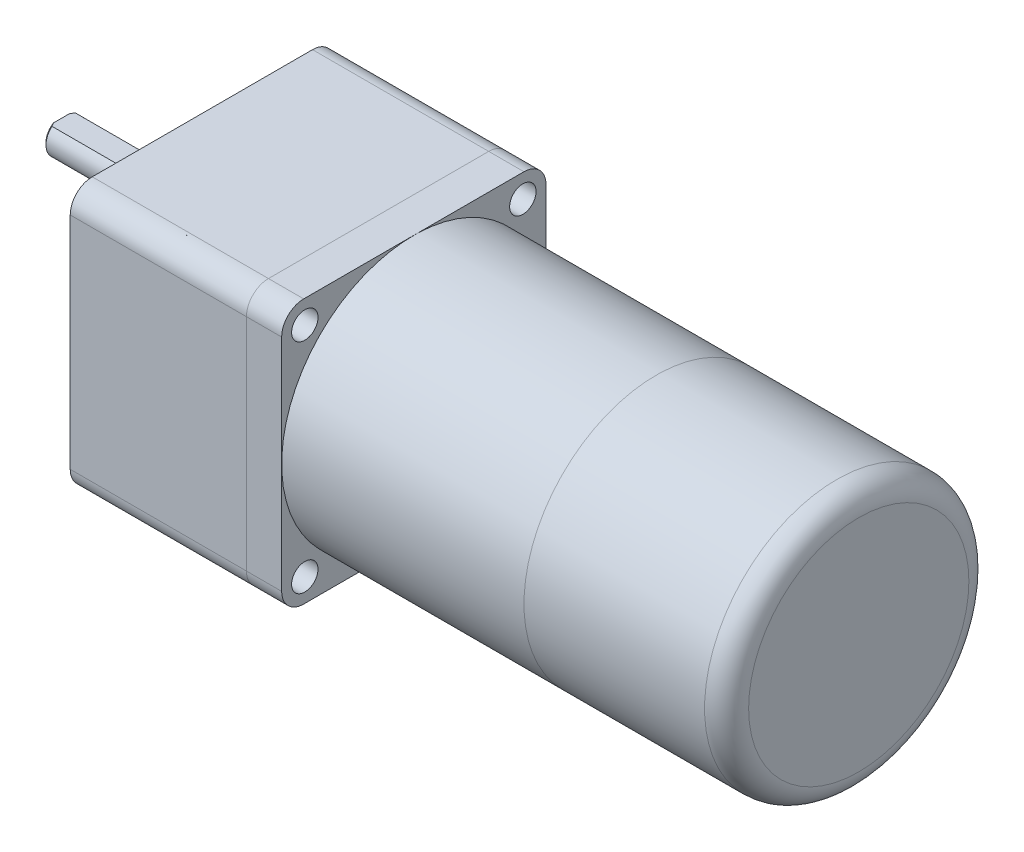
ISO-10303-21;
HEADER;
FILE_DESCRIPTION(('STEP AP214'),'2;1');
FILE_NAME('part.step','',(''),(''),'','','');
FILE_SCHEMA(('AUTOMOTIVE_DESIGN { 1 0 10303 214 1 1 1 1 }'));
ENDSEC;
DATA;
#1=APPLICATION_CONTEXT('core data for automotive mechanical design processes');
#2=APPLICATION_PROTOCOL_DEFINITION('international standard','automotive_design',2000,#1);
#3=PRODUCT_CONTEXT('',#1,'mechanical');
#4=PRODUCT('Part','Part','',(#3));
#5=PRODUCT_RELATED_PRODUCT_CATEGORY('part','',(#4));
#6=PRODUCT_DEFINITION_FORMATION('','',#4);
#7=PRODUCT_DEFINITION_CONTEXT('part definition',#1,'design');
#8=PRODUCT_DEFINITION('design','',#6,#7);
#9=PRODUCT_DEFINITION_SHAPE('','',#8);
#10=(LENGTH_UNIT() NAMED_UNIT(*) SI_UNIT(.MILLI.,.METRE.));
#11=(NAMED_UNIT(*) PLANE_ANGLE_UNIT() SI_UNIT($,.RADIAN.));
#12=(NAMED_UNIT(*) SI_UNIT($,.STERADIAN.) SOLID_ANGLE_UNIT());
#13=UNCERTAINTY_MEASURE_WITH_UNIT(LENGTH_MEASURE(1.E-05),#10,'distance_accuracy_value','');
#14=(GEOMETRIC_REPRESENTATION_CONTEXT(3) GLOBAL_UNCERTAINTY_ASSIGNED_CONTEXT((#13)) GLOBAL_UNIT_ASSIGNED_CONTEXT((#10,
#11,#12)) REPRESENTATION_CONTEXT('',''));
#15=CARTESIAN_POINT('',(0.,0.,0.));
#16=DIRECTION('',(0.,0.,1.));
#17=DIRECTION('',(1.,0.,0.));
#18=AXIS2_PLACEMENT_3D('',#15,#16,#17);
#19=CARTESIAN_POINT('',(-32.,10.,0.));
#20=DIRECTION('',(1.,0.,0.));
#21=DIRECTION('',(0.,0.,-1.));
#22=AXIS2_PLACEMENT_3D('',#19,#20,#21);
#23=CYLINDRICAL_SURFACE('',#22,4.);
#24=DIRECTION('',(-1.,0.,0.));
#25=VECTOR('',#24,1.);
#26=CARTESIAN_POINT('',(-7.,13.,2.64575131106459));
#27=LINE('',#26,#25);
#28=CARTESIAN_POINT('',(-7.,13.,2.64575131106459));
#29=VERTEX_POINT('',#28);
#30=CARTESIAN_POINT('',(-31.5,13.,2.64575131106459));
#31=VERTEX_POINT('',#30);
#32=EDGE_CURVE('E91',#29,#31,#27,.T.);
#33=ORIENTED_EDGE('',*,*,#32,.T.);
#34=CARTESIAN_POINT('',(-31.5,10.,0.));
#35=DIRECTION('',(-1.,0.,0.));
#36=DIRECTION('',(0.,0.,1.));
#37=AXIS2_PLACEMENT_3D('',#34,#35,#36);
#38=CIRCLE('',#37,4.);
#39=CARTESIAN_POINT('',(-31.5,13.,-2.64575131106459));
#40=VERTEX_POINT('',#39);
#41=EDGE_CURVE('E12',#31,#40,#38,.F.);
#42=ORIENTED_EDGE('',*,*,#41,.T.);
#43=DIRECTION('',(-1.,0.,0.));
#44=VECTOR('',#43,1.);
#45=CARTESIAN_POINT('',(-7.,13.,-2.64575131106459));
#46=LINE('',#45,#44);
#47=CARTESIAN_POINT('',(-7.,13.,-2.64575131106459));
#48=VERTEX_POINT('',#47);
#49=EDGE_CURVE('E89',#48,#40,#46,.T.);
#50=ORIENTED_EDGE('',*,*,#49,.F.);
#51=CARTESIAN_POINT('',(-7.,10.,0.));
#52=DIRECTION('',(-1.,0.,0.));
#53=DIRECTION('',(0.,0.,1.));
#54=AXIS2_PLACEMENT_3D('',#51,#52,#53);
#55=CIRCLE('',#54,4.);
#56=EDGE_CURVE('E82',#29,#48,#55,.T.);
#57=ORIENTED_EDGE('',*,*,#56,.F.);
#58=EDGE_LOOP('',(#33,#42,#50,#57));
#59=FACE_BOUND('',#58,.T.);
#60=CARTESIAN_POINT('',(-3.3,10.,0.));
#61=DIRECTION('',(-1.,0.,0.));
#62=DIRECTION('',(0.,0.,1.));
#63=AXIS2_PLACEMENT_3D('',#60,#61,#62);
#64=CIRCLE('',#63,4.);
#65=CARTESIAN_POINT('',(-3.3,10.,4.));
#66=VERTEX_POINT('',#65);
#67=EDGE_CURVE('E95',#66,#66,#64,.T.);
#68=ORIENTED_EDGE('',*,*,#67,.T.);
#69=EDGE_LOOP('',(#68));
#70=FACE_BOUND('',#69,.T.);
#71=ADVANCED_FACE('F48',(#59,#70),#23,.T.);
#72=CARTESIAN_POINT('',(-32.,10.,0.));
#73=DIRECTION('',(-1.,0.,0.));
#74=DIRECTION('',(0.,0.,1.));
#75=AXIS2_PLACEMENT_3D('',#72,#73,#74);
#76=PLANE('',#75);
#77=DIRECTION('',(0.,0.,1.));
#78=VECTOR('',#77,1.);
#79=CARTESIAN_POINT('',(-32.,13.,2.64575131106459));
#80=LINE('',#79,#78);
#81=CARTESIAN_POINT('',(-32.,13.,-1.80277563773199));
#82=VERTEX_POINT('',#81);
#83=CARTESIAN_POINT('',(-32.,13.,1.80277563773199));
#84=VERTEX_POINT('',#83);
#85=EDGE_CURVE('E86',#82,#84,#80,.T.);
#86=ORIENTED_EDGE('',*,*,#85,.F.);
#87=CARTESIAN_POINT('',(-32.,10.,0.));
#88=DIRECTION('',(-1.,0.,0.));
#89=DIRECTION('',(0.,0.,1.));
#90=AXIS2_PLACEMENT_3D('',#87,#88,#89);
#91=CIRCLE('',#90,3.5);
#92=EDGE_CURVE('E101',#82,#84,#91,.T.);
#93=ORIENTED_EDGE('',*,*,#92,.T.);
#94=EDGE_LOOP('',(#86,#93));
#95=FACE_BOUND('',#94,.T.);
#96=ADVANCED_FACE('F117',(#95),#76,.T.);
#97=CARTESIAN_POINT('',(-3.3,10.,0.));
#98=DIRECTION('',(-1.,0.,0.));
#99=DIRECTION('',(0.,0.,1.));
#100=AXIS2_PLACEMENT_3D('',#97,#98,#99);
#101=PLANE('',#100);
#102=ORIENTED_EDGE('',*,*,#67,.F.);
#103=EDGE_LOOP('',(#102));
#104=FACE_BOUND('',#103,.T.);
#105=ADVANCED_FACE('F116',(#104),#101,.F.);
#106=CARTESIAN_POINT('',(-7.,13.,2.64575131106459));
#107=DIRECTION('',(0.,-1.,0.));
#108=DIRECTION('',(0.,0.,-1.));
#109=AXIS2_PLACEMENT_3D('',#106,#107,#108);
#110=PLANE('',#109);
#111=ORIENTED_EDGE('',*,*,#85,.T.);
#112=CARTESIAN_POINT('',(-32.,13.,1.80277563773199));
#113=CARTESIAN_POINT('',(-31.962552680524,13.,1.87545495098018));
#114=CARTESIAN_POINT('',(-31.9238154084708,13.,1.94745530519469));
#115=CARTESIAN_POINT('',(-31.8441464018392,13.,2.09016482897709));
#116=CARTESIAN_POINT('',(-31.8032162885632,13.,2.16087490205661));
#117=CARTESIAN_POINT('',(-31.7194976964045,13.,2.30116567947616));
#118=CARTESIAN_POINT('',(-31.6767094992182,13.,2.37074655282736));
#119=CARTESIAN_POINT('',(-31.5895037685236,13.,2.50895192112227));
#120=CARTESIAN_POINT('',(-31.5450850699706,13.,2.57757568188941));
#121=CARTESIAN_POINT('',(-31.5,13.,2.64575131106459));
#122=B_SPLINE_CURVE_WITH_KNOTS('',3,(#112,#113,#114,#115,#116,#117,#118,#119,#120,#121),
.UNSPECIFIED.,.F.,.F.,(4,2,2,2,4),(0.,0.245246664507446,0.490314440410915,0.735345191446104,
0.980554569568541),.UNSPECIFIED.);
#123=EDGE_CURVE('E57',#84,#31,#122,.T.);
#124=ORIENTED_EDGE('',*,*,#123,.T.);
#125=ORIENTED_EDGE('',*,*,#32,.F.);
#126=DIRECTION('',(0.,0.,1.));
#127=VECTOR('',#126,1.);
#128=CARTESIAN_POINT('',(-7.,13.,2.64575131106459));
#129=LINE('',#128,#127);
#130=EDGE_CURVE('E85',#48,#29,#129,.T.);
#131=ORIENTED_EDGE('',*,*,#130,.F.);
#132=ORIENTED_EDGE('',*,*,#49,.T.);
#133=CARTESIAN_POINT('',(-31.5,13.,-2.64575131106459));
#134=CARTESIAN_POINT('',(-31.5450850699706,13.,-2.57757568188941));
#135=CARTESIAN_POINT('',(-31.5895037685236,13.,-2.50895192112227));
#136=CARTESIAN_POINT('',(-31.6767094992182,13.,-2.37074655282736));
#137=CARTESIAN_POINT('',(-31.7194976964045,13.,-2.30116567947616));
#138=CARTESIAN_POINT('',(-31.8032162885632,13.,-2.16087490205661));
#139=CARTESIAN_POINT('',(-31.8441464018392,13.,-2.09016482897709));
#140=CARTESIAN_POINT('',(-31.9238154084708,13.,-1.94745530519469));
#141=CARTESIAN_POINT('',(-31.962552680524,13.,-1.87545495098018));
#142=CARTESIAN_POINT('',(-32.,13.,-1.80277563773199));
#143=B_SPLINE_CURVE_WITH_KNOTS('',3,(#133,#134,#135,#136,#137,#138,#139,#140,#141,#142),
.UNSPECIFIED.,.F.,.F.,(4,2,2,2,4),(0.,0.245209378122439,0.490240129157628,0.735307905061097,
0.980554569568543),.UNSPECIFIED.);
#144=EDGE_CURVE('E104',#40,#82,#143,.T.);
#145=ORIENTED_EDGE('',*,*,#144,.T.);
#146=EDGE_LOOP('',(#111,#124,#125,#131,#132,#145));
#147=FACE_BOUND('',#146,.T.);
#148=ADVANCED_FACE('F88',(#147),#110,.F.);
#149=CARTESIAN_POINT('',(-7.,10.,0.));
#150=DIRECTION('',(-1.,0.,0.));
#151=DIRECTION('',(0.,0.,1.));
#152=AXIS2_PLACEMENT_3D('',#149,#150,#151);
#153=PLANE('',#152);
#154=ORIENTED_EDGE('',*,*,#56,.T.);
#155=ORIENTED_EDGE('',*,*,#130,.T.);
#156=EDGE_LOOP('',(#154,#155));
#157=FACE_BOUND('',#156,.T.);
#158=ADVANCED_FACE('F84',(#157),#153,.T.);
#159=CARTESIAN_POINT('',(-32.,10.,0.));
#160=DIRECTION('',(1.,0.,0.));
#161=DIRECTION('',(0.,0.,-1.));
#162=AXIS2_PLACEMENT_3D('',#159,#160,#161);
#163=CONICAL_SURFACE('',#162,3.5,0.785398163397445);
#164=ORIENTED_EDGE('',*,*,#144,.F.);
#165=ORIENTED_EDGE('',*,*,#41,.F.);
#166=ORIENTED_EDGE('',*,*,#123,.F.);
#167=ORIENTED_EDGE('',*,*,#92,.F.);
#168=EDGE_LOOP('',(#164,#165,#166,#167));
#169=FACE_BOUND('',#168,.T.);
#170=ADVANCED_FACE('F50',(#169),#163,.T.);
#171=CLOSED_SHELL('',(#71,#96,#105,#148,#158,#170));
#172=MANIFOLD_SOLID_BREP('B2',#171);
#173=CARTESIAN_POINT('',(-3.3,10.,0.));
#174=DIRECTION('',(1.,0.,0.));
#175=DIRECTION('',(0.,0.,-1.));
#176=AXIS2_PLACEMENT_3D('',#173,#174,#175);
#177=CYLINDRICAL_SURFACE('',#176,12.);
#178=CARTESIAN_POINT('',(-2.8,10.,0.));
#179=DIRECTION('',(-1.,0.,0.));
#180=DIRECTION('',(0.,0.,1.));
#181=AXIS2_PLACEMENT_3D('',#178,#179,#180);
#182=CIRCLE('',#181,12.);
#183=CARTESIAN_POINT('',(-2.8,10.,12.));
#184=VERTEX_POINT('',#183);
#185=EDGE_CURVE('E47',#184,#184,#182,.F.);
#186=ORIENTED_EDGE('',*,*,#185,.T.);
#187=EDGE_LOOP('',(#186));
#188=FACE_BOUND('',#187,.T.);
#189=CARTESIAN_POINT('',(0.,10.,0.));
#190=DIRECTION('',(-1.,0.,0.));
#191=DIRECTION('',(0.,0.,1.));
#192=AXIS2_PLACEMENT_3D('',#189,#190,#191);
#193=CIRCLE('',#192,12.);
#194=CARTESIAN_POINT('',(0.,10.,12.));
#195=VERTEX_POINT('',#194);
#196=EDGE_CURVE('E190',#195,#195,#193,.T.);
#197=ORIENTED_EDGE('',*,*,#196,.T.);
#198=EDGE_LOOP('',(#197));
#199=FACE_BOUND('',#198,.T.);
#200=ADVANCED_FACE('F179',(#188,#199),#177,.T.);
#201=CARTESIAN_POINT('',(-3.3,10.,0.));
#202=DIRECTION('',(-1.,0.,0.));
#203=DIRECTION('',(0.,0.,1.));
#204=AXIS2_PLACEMENT_3D('',#201,#202,#203);
#205=PLANE('',#204);
#206=CARTESIAN_POINT('',(-3.3,10.,0.));
#207=DIRECTION('',(-1.,0.,0.));
#208=DIRECTION('',(0.,0.,1.));
#209=AXIS2_PLACEMENT_3D('',#206,#207,#208);
#210=CIRCLE('',#209,11.5);
#211=CARTESIAN_POINT('',(-3.3,10.,11.5));
#212=VERTEX_POINT('',#211);
#213=EDGE_CURVE('E186',#212,#212,#210,.T.);
#214=ORIENTED_EDGE('',*,*,#213,.T.);
#215=EDGE_LOOP('',(#214));
#216=FACE_BOUND('',#215,.T.);
#217=ADVANCED_FACE('F200',(#216),#205,.T.);
#218=CARTESIAN_POINT('',(0.,10.,0.));
#219=DIRECTION('',(-1.,0.,0.));
#220=DIRECTION('',(0.,0.,1.));
#221=AXIS2_PLACEMENT_3D('',#218,#219,#220);
#222=PLANE('',#221);
#223=ORIENTED_EDGE('',*,*,#196,.F.);
#224=EDGE_LOOP('',(#223));
#225=FACE_BOUND('',#224,.T.);
#226=ADVANCED_FACE('F198',(#225),#222,.F.);
#227=CARTESIAN_POINT('',(-2.8,10.,0.));
#228=DIRECTION('',(-1.,0.,0.));
#229=DIRECTION('',(0.,0.,1.));
#230=AXIS2_PLACEMENT_3D('',#227,#228,#229);
#231=TOROIDAL_SURFACE('',#230,11.5,0.5);
#232=ORIENTED_EDGE('',*,*,#185,.F.);
#233=EDGE_LOOP('',(#232));
#234=FACE_BOUND('',#233,.T.);
#235=ORIENTED_EDGE('',*,*,#213,.F.);
#236=EDGE_LOOP('',(#235));
#237=FACE_BOUND('',#236,.T.);
#238=ADVANCED_FACE('F181',(#234,#237),#231,.T.);
#239=CLOSED_SHELL('',(#200,#217,#226,#238));
#240=MANIFOLD_SOLID_BREP('B6',#239);
#241=CARTESIAN_POINT('',(149.,0.,0.));
#242=DIRECTION('',(-1.,0.,0.));
#243=DIRECTION('',(0.,0.,1.));
#244=AXIS2_PLACEMENT_3D('',#241,#242,#243);
#245=CYLINDRICAL_SURFACE('',#244,30.);
#246=CARTESIAN_POINT('',(144.,0.,0.));
#247=DIRECTION('',(1.,0.,0.));
#248=DIRECTION('',(0.,0.,-1.));
#249=AXIS2_PLACEMENT_3D('',#246,#247,#248);
#250=CIRCLE('',#249,30.);
#251=CARTESIAN_POINT('',(144.,0.,-30.));
#252=VERTEX_POINT('',#251);
#253=EDGE_CURVE('E178',#252,#252,#250,.F.);
#254=ORIENTED_EDGE('',*,*,#253,.T.);
#255=EDGE_LOOP('',(#254));
#256=FACE_BOUND('',#255,.T.);
#257=CARTESIAN_POINT('',(103.,0.,0.));
#258=DIRECTION('',(1.,0.,0.));
#259=DIRECTION('',(0.,0.,-1.));
#260=AXIS2_PLACEMENT_3D('',#257,#258,#259);
#261=CIRCLE('',#260,30.);
#262=CARTESIAN_POINT('',(103.,0.,-30.));
#263=VERTEX_POINT('',#262);
#264=EDGE_CURVE('E254',#263,#263,#261,.T.);
#265=ORIENTED_EDGE('',*,*,#264,.T.);
#266=EDGE_LOOP('',(#265));
#267=FACE_BOUND('',#266,.T.);
#268=ADVANCED_FACE('F243',(#256,#267),#245,.T.);
#269=CARTESIAN_POINT('',(149.,0.,0.));
#270=DIRECTION('',(1.,0.,0.));
#271=DIRECTION('',(0.,0.,-1.));
#272=AXIS2_PLACEMENT_3D('',#269,#270,#271);
#273=PLANE('',#272);
#274=CARTESIAN_POINT('',(149.,0.,0.));
#275=DIRECTION('',(1.,0.,0.));
#276=DIRECTION('',(0.,0.,-1.));
#277=AXIS2_PLACEMENT_3D('',#274,#275,#276);
#278=CIRCLE('',#277,25.);
#279=CARTESIAN_POINT('',(149.,0.,-25.));
#280=VERTEX_POINT('',#279);
#281=EDGE_CURVE('E250',#280,#280,#278,.T.);
#282=ORIENTED_EDGE('',*,*,#281,.T.);
#283=EDGE_LOOP('',(#282));
#284=FACE_BOUND('',#283,.T.);
#285=ADVANCED_FACE('F264',(#284),#273,.T.);
#286=CARTESIAN_POINT('',(103.,0.,0.));
#287=DIRECTION('',(1.,0.,0.));
#288=DIRECTION('',(0.,0.,-1.));
#289=AXIS2_PLACEMENT_3D('',#286,#287,#288);
#290=PLANE('',#289);
#291=ORIENTED_EDGE('',*,*,#264,.F.);
#292=EDGE_LOOP('',(#291));
#293=FACE_BOUND('',#292,.T.);
#294=ADVANCED_FACE('F262',(#293),#290,.F.);
#295=CARTESIAN_POINT('',(144.,0.,0.));
#296=DIRECTION('',(1.,0.,0.));
#297=DIRECTION('',(0.,0.,-1.));
#298=AXIS2_PLACEMENT_3D('',#295,#296,#297);
#299=TOROIDAL_SURFACE('',#298,25.,5.);
#300=ORIENTED_EDGE('',*,*,#253,.F.);
#301=EDGE_LOOP('',(#300));
#302=FACE_BOUND('',#301,.T.);
#303=ORIENTED_EDGE('',*,*,#281,.F.);
#304=EDGE_LOOP('',(#303));
#305=FACE_BOUND('',#304,.T.);
#306=ADVANCED_FACE('F245',(#302,#305),#299,.T.);
#307=CLOSED_SHELL('',(#268,#285,#294,#306));
#308=MANIFOLD_SOLID_BREP('B42',#307);
#309=CARTESIAN_POINT('',(103.,0.,0.));
#310=DIRECTION('',(-1.,0.,0.));
#311=DIRECTION('',(0.,0.,1.));
#312=AXIS2_PLACEMENT_3D('',#309,#310,#311);
#313=CYLINDRICAL_SURFACE('',#312,30.);
#314=CARTESIAN_POINT('',(103.,0.,0.));
#315=DIRECTION('',(1.,0.,0.));
#316=DIRECTION('',(0.,0.,-1.));
#317=AXIS2_PLACEMENT_3D('',#314,#315,#316);
#318=CIRCLE('',#317,30.);
#319=CARTESIAN_POINT('',(103.,0.,-30.));
#320=VERTEX_POINT('',#319);
#321=EDGE_CURVE('E242',#320,#320,#318,.T.);
#322=ORIENTED_EDGE('',*,*,#321,.F.);
#323=EDGE_LOOP('',(#322));
#324=FACE_BOUND('',#323,.T.);
#325=CARTESIAN_POINT('',(48.,0.,0.));
#326=DIRECTION('',(1.,0.,0.));
#327=DIRECTION('',(0.,0.,-1.));
#328=AXIS2_PLACEMENT_3D('',#325,#326,#327);
#329=CIRCLE('',#328,30.);
#330=CARTESIAN_POINT('',(48.,0.,-30.));
#331=VERTEX_POINT('',#330);
#332=EDGE_CURVE('E312',#331,#331,#329,.T.);
#333=ORIENTED_EDGE('',*,*,#332,.T.);
#334=EDGE_LOOP('',(#333));
#335=FACE_BOUND('',#334,.T.);
#336=ADVANCED_FACE('F309',(#324,#335),#313,.T.);
#337=CARTESIAN_POINT('',(103.,0.,0.));
#338=DIRECTION('',(1.,0.,0.));
#339=DIRECTION('',(0.,0.,-1.));
#340=AXIS2_PLACEMENT_3D('',#337,#338,#339);
#341=PLANE('',#340);
#342=ORIENTED_EDGE('',*,*,#321,.T.);
#343=EDGE_LOOP('',(#342));
#344=FACE_BOUND('',#343,.T.);
#345=ADVANCED_FACE('F324',(#344),#341,.T.);
#346=CARTESIAN_POINT('',(48.,0.,0.));
#347=DIRECTION('',(1.,0.,0.));
#348=DIRECTION('',(0.,0.,-1.));
#349=AXIS2_PLACEMENT_3D('',#346,#347,#348);
#350=PLANE('',#349);
#351=ORIENTED_EDGE('',*,*,#332,.F.);
#352=EDGE_LOOP('',(#351));
#353=FACE_BOUND('',#352,.T.);
#354=ADVANCED_FACE('F322',(#353),#350,.F.);
#355=CLOSED_SHELL('',(#336,#345,#354));
#356=MANIFOLD_SOLID_BREP('B173',#355);
#357=CARTESIAN_POINT('',(48.,-25.,25.));
#358=DIRECTION('',(-1.,0.,0.));
#359=DIRECTION('',(0.,0.,1.));
#360=AXIS2_PLACEMENT_3D('',#357,#358,#359);
#361=CYLINDRICAL_SURFACE('',#360,5.);
#362=CARTESIAN_POINT('',(40.,-25.,25.));
#363=DIRECTION('',(1.,0.,0.));
#364=DIRECTION('',(0.,0.,1.));
#365=AXIS2_PLACEMENT_3D('',#362,#363,#364);
#366=CIRCLE('',#365,5.);
#367=CARTESIAN_POINT('',(40.,-25.,30.));
#368=VERTEX_POINT('',#367);
#369=CARTESIAN_POINT('',(40.,-30.,25.));
#370=VERTEX_POINT('',#369);
#371=EDGE_CURVE('E457',#368,#370,#366,.T.);
#372=ORIENTED_EDGE('',*,*,#371,.T.);
#373=DIRECTION('',(-1.,0.,0.));
#374=VECTOR('',#373,1.);
#375=CARTESIAN_POINT('',(48.,-30.,25.));
#376=LINE('',#375,#374);
#377=CARTESIAN_POINT('',(48.,-30.,25.));
#378=VERTEX_POINT('',#377);
#379=EDGE_CURVE('E307',#378,#370,#376,.T.);
#380=ORIENTED_EDGE('',*,*,#379,.F.);
#381=CARTESIAN_POINT('',(48.,-25.,25.));
#382=DIRECTION('',(1.,0.,0.));
#383=DIRECTION('',(0.,0.,1.));
#384=AXIS2_PLACEMENT_3D('',#381,#382,#383);
#385=CIRCLE('',#384,5.);
#386=CARTESIAN_POINT('',(48.,-25.,30.));
#387=VERTEX_POINT('',#386);
#388=EDGE_CURVE('E471',#387,#378,#385,.T.);
#389=ORIENTED_EDGE('',*,*,#388,.F.);
#390=DIRECTION('',(-1.,0.,0.));
#391=VECTOR('',#390,1.);
#392=CARTESIAN_POINT('',(48.,-25.,30.));
#393=LINE('',#392,#391);
#394=EDGE_CURVE('E453',#387,#368,#393,.T.);
#395=ORIENTED_EDGE('',*,*,#394,.T.);
#396=EDGE_LOOP('',(#372,#380,#389,#395));
#397=FACE_BOUND('',#396,.T.);
#398=ADVANCED_FACE('F359',(#397),#361,.T.);
#399=CARTESIAN_POINT('',(48.,-30.,25.));
#400=DIRECTION('',(0.,1.,0.));
#401=DIRECTION('',(0.,0.,1.));
#402=AXIS2_PLACEMENT_3D('',#399,#400,#401);
#403=PLANE('',#402);
#404=DIRECTION('',(0.,0.,-1.));
#405=VECTOR('',#404,1.);
#406=CARTESIAN_POINT('',(40.,-30.,25.));
#407=LINE('',#406,#405);
#408=CARTESIAN_POINT('',(40.,-30.,-25.));
#409=VERTEX_POINT('',#408);
#410=EDGE_CURVE('E460',#370,#409,#407,.T.);
#411=ORIENTED_EDGE('',*,*,#410,.T.);
#412=DIRECTION('',(-1.,0.,0.));
#413=VECTOR('',#412,1.);
#414=CARTESIAN_POINT('',(48.,-30.,-25.));
#415=LINE('',#414,#413);
#416=CARTESIAN_POINT('',(48.,-30.,-25.));
#417=VERTEX_POINT('',#416);
#418=EDGE_CURVE('E368',#417,#409,#415,.T.);
#419=ORIENTED_EDGE('',*,*,#418,.F.);
#420=DIRECTION('',(0.,0.,-1.));
#421=VECTOR('',#420,1.);
#422=CARTESIAN_POINT('',(48.,-30.,25.));
#423=LINE('',#422,#421);
#424=EDGE_CURVE('E420',#378,#417,#423,.T.);
#425=ORIENTED_EDGE('',*,*,#424,.F.);
#426=ORIENTED_EDGE('',*,*,#379,.T.);
#427=EDGE_LOOP('',(#411,#419,#425,#426));
#428=FACE_BOUND('',#427,.T.);
#429=ADVANCED_FACE('F525',(#428),#403,.F.);
#430=CARTESIAN_POINT('',(48.,-25.,-25.));
#431=DIRECTION('',(-1.,0.,0.));
#432=DIRECTION('',(0.,0.,1.));
#433=AXIS2_PLACEMENT_3D('',#430,#431,#432);
#434=CYLINDRICAL_SURFACE('',#433,5.);
#435=CARTESIAN_POINT('',(40.,-25.,-25.));
#436=DIRECTION('',(1.,0.,0.));
#437=DIRECTION('',(0.,0.,-1.));
#438=AXIS2_PLACEMENT_3D('',#435,#436,#437);
#439=CIRCLE('',#438,5.);
#440=CARTESIAN_POINT('',(40.,-25.,-30.));
#441=VERTEX_POINT('',#440);
#442=EDGE_CURVE('E462',#409,#441,#439,.T.);
#443=ORIENTED_EDGE('',*,*,#442,.T.);
#444=DIRECTION('',(-1.,0.,0.));
#445=VECTOR('',#444,1.);
#446=CARTESIAN_POINT('',(48.,-25.,-30.));
#447=LINE('',#446,#445);
#448=CARTESIAN_POINT('',(48.,-25.,-30.));
#449=VERTEX_POINT('',#448);
#450=EDGE_CURVE('E478',#449,#441,#447,.T.);
#451=ORIENTED_EDGE('',*,*,#450,.F.);
#452=CARTESIAN_POINT('',(48.,-25.,-25.));
#453=DIRECTION('',(1.,0.,0.));
#454=DIRECTION('',(0.,0.,-1.));
#455=AXIS2_PLACEMENT_3D('',#452,#453,#454);
#456=CIRCLE('',#455,5.);
#457=EDGE_CURVE('E626',#417,#449,#456,.T.);
#458=ORIENTED_EDGE('',*,*,#457,.F.);
#459=ORIENTED_EDGE('',*,*,#418,.T.);
#460=EDGE_LOOP('',(#443,#451,#458,#459));
#461=FACE_BOUND('',#460,.T.);
#462=ADVANCED_FACE('F529',(#461),#434,.T.);
#463=CARTESIAN_POINT('',(48.,-25.,-30.));
#464=DIRECTION('',(0.,0.,1.));
#465=DIRECTION('',(1.,0.,0.));
#466=AXIS2_PLACEMENT_3D('',#463,#464,#465);
#467=PLANE('',#466);
#468=DIRECTION('',(0.,1.,0.));
#469=VECTOR('',#468,1.);
#470=CARTESIAN_POINT('',(40.,-25.,-30.));
#471=LINE('',#470,#469);
#472=CARTESIAN_POINT('',(40.,25.,-30.));
#473=VERTEX_POINT('',#472);
#474=EDGE_CURVE('E464',#441,#473,#471,.T.);
#475=ORIENTED_EDGE('',*,*,#474,.T.);
#476=DIRECTION('',(-1.,0.,0.));
#477=VECTOR('',#476,1.);
#478=CARTESIAN_POINT('',(48.,25.,-30.));
#479=LINE('',#478,#477);
#480=CARTESIAN_POINT('',(48.,25.,-30.));
#481=VERTEX_POINT('',#480);
#482=EDGE_CURVE('E475',#481,#473,#479,.T.);
#483=ORIENTED_EDGE('',*,*,#482,.F.);
#484=DIRECTION('',(0.,1.,0.));
#485=VECTOR('',#484,1.);
#486=CARTESIAN_POINT('',(48.,-25.,-30.));
#487=LINE('',#486,#485);
#488=EDGE_CURVE('E628',#449,#481,#487,.T.);
#489=ORIENTED_EDGE('',*,*,#488,.F.);
#490=ORIENTED_EDGE('',*,*,#450,.T.);
#491=EDGE_LOOP('',(#475,#483,#489,#490));
#492=FACE_BOUND('',#491,.T.);
#493=ADVANCED_FACE('F533',(#492),#467,.F.);
#494=CARTESIAN_POINT('',(48.,25.,-25.));
#495=DIRECTION('',(-1.,0.,0.));
#496=DIRECTION('',(0.,0.,1.));
#497=AXIS2_PLACEMENT_3D('',#494,#495,#496);
#498=CYLINDRICAL_SURFACE('',#497,5.);
#499=CARTESIAN_POINT('',(40.,25.,-25.));
#500=DIRECTION('',(1.,0.,0.));
#501=DIRECTION('',(0.,0.,1.));
#502=AXIS2_PLACEMENT_3D('',#499,#500,#501);
#503=CIRCLE('',#502,5.);
#504=CARTESIAN_POINT('',(40.,30.,-25.));
#505=VERTEX_POINT('',#504);
#506=EDGE_CURVE('E466',#473,#505,#503,.T.);
#507=ORIENTED_EDGE('',*,*,#506,.T.);
#508=DIRECTION('',(-1.,0.,0.));
#509=VECTOR('',#508,1.);
#510=CARTESIAN_POINT('',(48.,30.,-25.));
#511=LINE('',#510,#509);
#512=CARTESIAN_POINT('',(48.,30.,-25.));
#513=VERTEX_POINT('',#512);
#514=EDGE_CURVE('E448',#513,#505,#511,.T.);
#515=ORIENTED_EDGE('',*,*,#514,.F.);
#516=CARTESIAN_POINT('',(48.,25.,-25.));
#517=DIRECTION('',(1.,0.,0.));
#518=DIRECTION('',(0.,0.,1.));
#519=AXIS2_PLACEMENT_3D('',#516,#517,#518);
#520=CIRCLE('',#519,5.);
#521=EDGE_CURVE('E439',#481,#513,#520,.T.);
#522=ORIENTED_EDGE('',*,*,#521,.F.);
#523=ORIENTED_EDGE('',*,*,#482,.T.);
#524=EDGE_LOOP('',(#507,#515,#522,#523));
#525=FACE_BOUND('',#524,.T.);
#526=ADVANCED_FACE('F539',(#525),#498,.T.);
#527=CARTESIAN_POINT('',(48.,30.,25.));
#528=DIRECTION('',(0.,-1.,0.));
#529=DIRECTION('',(0.,0.,-1.));
#530=AXIS2_PLACEMENT_3D('',#527,#528,#529);
#531=PLANE('',#530);
#532=DIRECTION('',(0.,0.,1.));
#533=VECTOR('',#532,1.);
#534=CARTESIAN_POINT('',(40.,30.,25.));
#535=LINE('',#534,#533);
#536=CARTESIAN_POINT('',(40.,30.,25.));
#537=VERTEX_POINT('',#536);
#538=EDGE_CURVE('E447',#505,#537,#535,.T.);
#539=ORIENTED_EDGE('',*,*,#538,.T.);
#540=DIRECTION('',(-1.,0.,0.));
#541=VECTOR('',#540,1.);
#542=CARTESIAN_POINT('',(48.,30.,25.));
#543=LINE('',#542,#541);
#544=CARTESIAN_POINT('',(48.,30.,25.));
#545=VERTEX_POINT('',#544);
#546=EDGE_CURVE('E444',#545,#537,#543,.T.);
#547=ORIENTED_EDGE('',*,*,#546,.F.);
#548=DIRECTION('',(0.,0.,1.));
#549=VECTOR('',#548,1.);
#550=CARTESIAN_POINT('',(48.,30.,25.));
#551=LINE('',#550,#549);
#552=EDGE_CURVE('E433',#513,#545,#551,.T.);
#553=ORIENTED_EDGE('',*,*,#552,.F.);
#554=ORIENTED_EDGE('',*,*,#514,.T.);
#555=EDGE_LOOP('',(#539,#547,#553,#554));
#556=FACE_BOUND('',#555,.T.);
#557=ADVANCED_FACE('F445',(#556),#531,.F.);
#558=CARTESIAN_POINT('',(48.,25.,25.));
#559=DIRECTION('',(-1.,0.,0.));
#560=DIRECTION('',(0.,0.,1.));
#561=AXIS2_PLACEMENT_3D('',#558,#559,#560);
#562=CYLINDRICAL_SURFACE('',#561,5.);
#563=CARTESIAN_POINT('',(40.,25.,25.));
#564=DIRECTION('',(1.,0.,0.));
#565=DIRECTION('',(0.,0.,1.));
#566=AXIS2_PLACEMENT_3D('',#563,#564,#565);
#567=CIRCLE('',#566,5.);
#568=CARTESIAN_POINT('',(40.,25.,30.));
#569=VERTEX_POINT('',#568);
#570=EDGE_CURVE('E406',#537,#569,#567,.T.);
#571=ORIENTED_EDGE('',*,*,#570,.T.);
#572=DIRECTION('',(-1.,0.,0.));
#573=VECTOR('',#572,1.);
#574=CARTESIAN_POINT('',(48.,25.,30.));
#575=LINE('',#574,#573);
#576=CARTESIAN_POINT('',(48.,25.,30.));
#577=VERTEX_POINT('',#576);
#578=EDGE_CURVE('E449',#577,#569,#575,.T.);
#579=ORIENTED_EDGE('',*,*,#578,.F.);
#580=CARTESIAN_POINT('',(48.,25.,25.));
#581=DIRECTION('',(1.,0.,0.));
#582=DIRECTION('',(0.,0.,1.));
#583=AXIS2_PLACEMENT_3D('',#580,#581,#582);
#584=CIRCLE('',#583,5.);
#585=EDGE_CURVE('E437',#545,#577,#584,.T.);
#586=ORIENTED_EDGE('',*,*,#585,.F.);
#587=ORIENTED_EDGE('',*,*,#546,.T.);
#588=EDGE_LOOP('',(#571,#579,#586,#587));
#589=FACE_BOUND('',#588,.T.);
#590=ADVANCED_FACE('F451',(#589),#562,.T.);
#591=CARTESIAN_POINT('',(48.,-25.,30.));
#592=DIRECTION('',(0.,0.,-1.));
#593=DIRECTION('',(-1.,0.,0.));
#594=AXIS2_PLACEMENT_3D('',#591,#592,#593);
#595=PLANE('',#594);
#596=DIRECTION('',(0.,-1.,0.));
#597=VECTOR('',#596,1.);
#598=CARTESIAN_POINT('',(40.,-25.,30.));
#599=LINE('',#598,#597);
#600=EDGE_CURVE('E412',#569,#368,#599,.T.);
#601=ORIENTED_EDGE('',*,*,#600,.T.);
#602=ORIENTED_EDGE('',*,*,#394,.F.);
#603=DIRECTION('',(0.,-1.,0.));
#604=VECTOR('',#603,1.);
#605=CARTESIAN_POINT('',(48.,-25.,30.));
#606=LINE('',#605,#604);
#607=EDGE_CURVE('E377',#577,#387,#606,.T.);
#608=ORIENTED_EDGE('',*,*,#607,.F.);
#609=ORIENTED_EDGE('',*,*,#578,.T.);
#610=EDGE_LOOP('',(#601,#602,#608,#609));
#611=FACE_BOUND('',#610,.T.);
#612=ADVANCED_FACE('F514',(#611),#595,.F.);
#613=CARTESIAN_POINT('',(48.,-25.,25.));
#614=DIRECTION('',(-1.,0.,0.));
#615=DIRECTION('',(0.,0.,1.));
#616=AXIS2_PLACEMENT_3D('',#613,#614,#615);
#617=PLANE('',#616);
#618=CARTESIAN_POINT('',(48.,24.7487373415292,24.7487373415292));
#619=DIRECTION('',(1.,0.,0.));
#620=DIRECTION('',(0.,0.,-1.));
#621=AXIS2_PLACEMENT_3D('',#618,#619,#620);
#622=CIRCLE('',#621,3.);
#623=CARTESIAN_POINT('',(48.,24.7487373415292,21.7487373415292));
#624=VERTEX_POINT('',#623);
#625=EDGE_CURVE('E487',#624,#624,#622,.T.);
#626=ORIENTED_EDGE('',*,*,#625,.F.);
#627=EDGE_LOOP('',(#626));
#628=FACE_BOUND('',#627,.T.);
#629=CARTESIAN_POINT('',(48.,24.7487373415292,-24.7487373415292));
#630=DIRECTION('',(1.,0.,0.));
#631=DIRECTION('',(0.,0.,-1.));
#632=AXIS2_PLACEMENT_3D('',#629,#630,#631);
#633=CIRCLE('',#632,3.);
#634=CARTESIAN_POINT('',(48.,24.7487373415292,-27.7487373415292));
#635=VERTEX_POINT('',#634);
#636=EDGE_CURVE('E612',#635,#635,#633,.T.);
#637=ORIENTED_EDGE('',*,*,#636,.F.);
#638=EDGE_LOOP('',(#637));
#639=FACE_BOUND('',#638,.T.);
#640=CARTESIAN_POINT('',(48.,-24.7487373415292,-24.7487373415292));
#641=DIRECTION('',(1.,0.,0.));
#642=DIRECTION('',(0.,0.,-1.));
#643=AXIS2_PLACEMENT_3D('',#640,#641,#642);
#644=CIRCLE('',#643,3.);
#645=CARTESIAN_POINT('',(48.,-24.7487373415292,-27.7487373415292));
#646=VERTEX_POINT('',#645);
#647=EDGE_CURVE('E614',#646,#646,#644,.T.);
#648=ORIENTED_EDGE('',*,*,#647,.F.);
#649=EDGE_LOOP('',(#648));
#650=FACE_BOUND('',#649,.T.);
#651=CARTESIAN_POINT('',(48.,-24.7487373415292,24.7487373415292));
#652=DIRECTION('',(1.,0.,0.));
#653=DIRECTION('',(0.,0.,-1.));
#654=AXIS2_PLACEMENT_3D('',#651,#652,#653);
#655=CIRCLE('',#654,3.);
#656=CARTESIAN_POINT('',(48.,-24.7487373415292,21.7487373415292));
#657=VERTEX_POINT('',#656);
#658=EDGE_CURVE('E619',#657,#657,#655,.T.);
#659=ORIENTED_EDGE('',*,*,#658,.F.);
#660=EDGE_LOOP('',(#659));
#661=FACE_BOUND('',#660,.T.);
#662=ORIENTED_EDGE('',*,*,#388,.T.);
#663=ORIENTED_EDGE('',*,*,#424,.T.);
#664=ORIENTED_EDGE('',*,*,#457,.T.);
#665=ORIENTED_EDGE('',*,*,#488,.T.);
#666=ORIENTED_EDGE('',*,*,#521,.T.);
#667=ORIENTED_EDGE('',*,*,#552,.T.);
#668=ORIENTED_EDGE('',*,*,#585,.T.);
#669=ORIENTED_EDGE('',*,*,#607,.T.);
#670=EDGE_LOOP('',(#662,#663,#664,#665,#666,#667,#668,#669));
#671=FACE_BOUND('',#670,.T.);
#672=ADVANCED_FACE('F435',(#628,#639,#650,#661,#671),#617,.F.);
#673=CARTESIAN_POINT('',(40.,-25.,25.));
#674=DIRECTION('',(-1.,0.,0.));
#675=DIRECTION('',(0.,0.,1.));
#676=AXIS2_PLACEMENT_3D('',#673,#674,#675);
#677=PLANE('',#676);
#678=CARTESIAN_POINT('',(40.,24.7487373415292,24.7487373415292));
#679=DIRECTION('',(-1.,0.,0.));
#680=DIRECTION('',(0.,0.,1.));
#681=AXIS2_PLACEMENT_3D('',#678,#679,#680);
#682=CIRCLE('',#681,3.);
#683=CARTESIAN_POINT('',(40.,24.7487373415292,27.7487373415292));
#684=VERTEX_POINT('',#683);
#685=EDGE_CURVE('E362',#684,#684,#682,.T.);
#686=ORIENTED_EDGE('',*,*,#685,.F.);
#687=EDGE_LOOP('',(#686));
#688=FACE_BOUND('',#687,.T.);
#689=CARTESIAN_POINT('',(40.,24.7487373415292,-24.7487373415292));
#690=DIRECTION('',(-1.,0.,0.));
#691=DIRECTION('',(0.,0.,1.));
#692=AXIS2_PLACEMENT_3D('',#689,#690,#691);
#693=CIRCLE('',#692,3.);
#694=CARTESIAN_POINT('',(40.,24.7487373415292,-21.7487373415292));
#695=VERTEX_POINT('',#694);
#696=EDGE_CURVE('E489',#695,#695,#693,.T.);
#697=ORIENTED_EDGE('',*,*,#696,.F.);
#698=EDGE_LOOP('',(#697));
#699=FACE_BOUND('',#698,.T.);
#700=CARTESIAN_POINT('',(40.,-24.7487373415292,-24.7487373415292));
#701=DIRECTION('',(-1.,0.,0.));
#702=DIRECTION('',(0.,0.,1.));
#703=AXIS2_PLACEMENT_3D('',#700,#701,#702);
#704=CIRCLE('',#703,3.);
#705=CARTESIAN_POINT('',(40.,-24.7487373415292,-21.7487373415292));
#706=VERTEX_POINT('',#705);
#707=EDGE_CURVE('E486',#706,#706,#704,.T.);
#708=ORIENTED_EDGE('',*,*,#707,.F.);
#709=EDGE_LOOP('',(#708));
#710=FACE_BOUND('',#709,.T.);
#711=CARTESIAN_POINT('',(40.,-24.7487373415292,24.7487373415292));
#712=DIRECTION('',(-1.,0.,0.));
#713=DIRECTION('',(0.,0.,1.));
#714=AXIS2_PLACEMENT_3D('',#711,#712,#713);
#715=CIRCLE('',#714,3.);
#716=CARTESIAN_POINT('',(40.,-24.7487373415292,27.7487373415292));
#717=VERTEX_POINT('',#716);
#718=EDGE_CURVE('E483',#717,#717,#715,.T.);
#719=ORIENTED_EDGE('',*,*,#718,.F.);
#720=EDGE_LOOP('',(#719));
#721=FACE_BOUND('',#720,.T.);
#722=ORIENTED_EDGE('',*,*,#371,.F.);
#723=ORIENTED_EDGE('',*,*,#600,.F.);
#724=ORIENTED_EDGE('',*,*,#570,.F.);
#725=ORIENTED_EDGE('',*,*,#538,.F.);
#726=ORIENTED_EDGE('',*,*,#506,.F.);
#727=ORIENTED_EDGE('',*,*,#474,.F.);
#728=ORIENTED_EDGE('',*,*,#442,.F.);
#729=ORIENTED_EDGE('',*,*,#410,.F.);
#730=EDGE_LOOP('',(#722,#723,#724,#725,#726,#727,#728,#729));
#731=FACE_BOUND('',#730,.T.);
#732=ADVANCED_FACE('F499',(#688,#699,#710,#721,#731),#677,.T.);
#733=CARTESIAN_POINT('',(11.5,-24.7487373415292,24.7487373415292));
#734=DIRECTION('',(1.,0.,0.));
#735=DIRECTION('',(0.,0.,-1.));
#736=AXIS2_PLACEMENT_3D('',#733,#734,#735);
#737=CYLINDRICAL_SURFACE('',#736,3.);
#738=ORIENTED_EDGE('',*,*,#718,.T.);
#739=EDGE_LOOP('',(#738));
#740=FACE_BOUND('',#739,.T.);
#741=ORIENTED_EDGE('',*,*,#658,.T.);
#742=EDGE_LOOP('',(#741));
#743=FACE_BOUND('',#742,.T.);
#744=ADVANCED_FACE('F502',(#740,#743),#737,.F.);
#745=CARTESIAN_POINT('',(11.5,-24.7487373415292,-24.7487373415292));
#746=DIRECTION('',(1.,0.,0.));
#747=DIRECTION('',(0.,0.,-1.));
#748=AXIS2_PLACEMENT_3D('',#745,#746,#747);
#749=CYLINDRICAL_SURFACE('',#748,3.);
#750=ORIENTED_EDGE('',*,*,#707,.T.);
#751=EDGE_LOOP('',(#750));
#752=FACE_BOUND('',#751,.T.);
#753=ORIENTED_EDGE('',*,*,#647,.T.);
#754=EDGE_LOOP('',(#753));
#755=FACE_BOUND('',#754,.T.);
#756=ADVANCED_FACE('F578',(#752,#755),#749,.F.);
#757=CARTESIAN_POINT('',(11.5,24.7487373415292,-24.7487373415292));
#758=DIRECTION('',(1.,0.,0.));
#759=DIRECTION('',(0.,0.,-1.));
#760=AXIS2_PLACEMENT_3D('',#757,#758,#759);
#761=CYLINDRICAL_SURFACE('',#760,3.);
#762=ORIENTED_EDGE('',*,*,#696,.T.);
#763=EDGE_LOOP('',(#762));
#764=FACE_BOUND('',#763,.T.);
#765=ORIENTED_EDGE('',*,*,#636,.T.);
#766=EDGE_LOOP('',(#765));
#767=FACE_BOUND('',#766,.T.);
#768=ADVANCED_FACE('F588',(#764,#767),#761,.F.);
#769=CARTESIAN_POINT('',(11.5,24.7487373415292,24.7487373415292));
#770=DIRECTION('',(1.,0.,0.));
#771=DIRECTION('',(0.,0.,-1.));
#772=AXIS2_PLACEMENT_3D('',#769,#770,#771);
#773=CYLINDRICAL_SURFACE('',#772,3.);
#774=ORIENTED_EDGE('',*,*,#685,.T.);
#775=EDGE_LOOP('',(#774));
#776=FACE_BOUND('',#775,.T.);
#777=ORIENTED_EDGE('',*,*,#625,.T.);
#778=EDGE_LOOP('',(#777));
#779=FACE_BOUND('',#778,.T.);
#780=ADVANCED_FACE('F496',(#776,#779),#773,.F.);
#781=CLOSED_SHELL('',(#398,#429,#462,#493,#526,#557,#590,#612,#672,#732,#744,#756,#768,#780));
#782=MANIFOLD_SOLID_BREP('B237',#781);
#783=CARTESIAN_POINT('',(40.,-25.,25.));
#784=DIRECTION('',(-1.,0.,0.));
#785=DIRECTION('',(0.,0.,1.));
#786=AXIS2_PLACEMENT_3D('',#783,#784,#785);
#787=CYLINDRICAL_SURFACE('',#786,5.);
#788=CARTESIAN_POINT('',(0.,-25.,25.));
#789=DIRECTION('',(1.,0.,0.));
#790=DIRECTION('',(0.,0.,1.));
#791=AXIS2_PLACEMENT_3D('',#788,#789,#790);
#792=CIRCLE('',#791,5.);
#793=CARTESIAN_POINT('',(0.,-25.,30.));
#794=VERTEX_POINT('',#793);
#795=CARTESIAN_POINT('',(0.,-30.,25.));
#796=VERTEX_POINT('',#795);
#797=EDGE_CURVE('E769',#794,#796,#792,.T.);
#798=ORIENTED_EDGE('',*,*,#797,.T.);
#799=DIRECTION('',(-1.,0.,0.));
#800=VECTOR('',#799,1.);
#801=CARTESIAN_POINT('',(40.,-30.,25.));
#802=LINE('',#801,#800);
#803=CARTESIAN_POINT('',(40.,-30.,25.));
#804=VERTEX_POINT('',#803);
#805=EDGE_CURVE('E797',#804,#796,#802,.T.);
#806=ORIENTED_EDGE('',*,*,#805,.F.);
#807=CARTESIAN_POINT('',(40.,-25.,25.));
#808=DIRECTION('',(1.,0.,0.));
#809=DIRECTION('',(0.,0.,1.));
#810=AXIS2_PLACEMENT_3D('',#807,#808,#809);
#811=CIRCLE('',#810,5.);
#812=CARTESIAN_POINT('',(40.,-25.,30.));
#813=VERTEX_POINT('',#812);
#814=EDGE_CURVE('E784',#813,#804,#811,.T.);
#815=ORIENTED_EDGE('',*,*,#814,.F.);
#816=DIRECTION('',(-1.,0.,0.));
#817=VECTOR('',#816,1.);
#818=CARTESIAN_POINT('',(40.,-25.,30.));
#819=LINE('',#818,#817);
#820=EDGE_CURVE('E765',#813,#794,#819,.T.);
#821=ORIENTED_EDGE('',*,*,#820,.T.);
#822=EDGE_LOOP('',(#798,#806,#815,#821));
#823=FACE_BOUND('',#822,.T.);
#824=ADVANCED_FACE('F671',(#823),#787,.T.);
#825=CARTESIAN_POINT('',(40.,-30.,25.));
#826=DIRECTION('',(0.,1.,0.));
#827=DIRECTION('',(0.,0.,1.));
#828=AXIS2_PLACEMENT_3D('',#825,#826,#827);
#829=PLANE('',#828);
#830=DIRECTION('',(0.,0.,-1.));
#831=VECTOR('',#830,1.);
#832=CARTESIAN_POINT('',(0.,-30.,25.));
#833=LINE('',#832,#831);
#834=CARTESIAN_POINT('',(0.,-30.,-25.));
#835=VERTEX_POINT('',#834);
#836=EDGE_CURVE('E772',#796,#835,#833,.T.);
#837=ORIENTED_EDGE('',*,*,#836,.T.);
#838=DIRECTION('',(-1.,0.,0.));
#839=VECTOR('',#838,1.);
#840=CARTESIAN_POINT('',(40.,-30.,-25.));
#841=LINE('',#840,#839);
#842=CARTESIAN_POINT('',(40.,-30.,-25.));
#843=VERTEX_POINT('',#842);
#844=EDGE_CURVE('E794',#843,#835,#841,.T.);
#845=ORIENTED_EDGE('',*,*,#844,.F.);
#846=DIRECTION('',(0.,0.,-1.));
#847=VECTOR('',#846,1.);
#848=CARTESIAN_POINT('',(40.,-30.,25.));
#849=LINE('',#848,#847);
#850=EDGE_CURVE('E732',#804,#843,#849,.T.);
#851=ORIENTED_EDGE('',*,*,#850,.F.);
#852=ORIENTED_EDGE('',*,*,#805,.T.);
#853=EDGE_LOOP('',(#837,#845,#851,#852));
#854=FACE_BOUND('',#853,.T.);
#855=ADVANCED_FACE('F853',(#854),#829,.F.);
#856=CARTESIAN_POINT('',(40.,-25.,-25.));
#857=DIRECTION('',(-1.,0.,0.));
#858=DIRECTION('',(0.,0.,1.));
#859=AXIS2_PLACEMENT_3D('',#856,#857,#858);
#860=CYLINDRICAL_SURFACE('',#859,5.);
#861=CARTESIAN_POINT('',(0.,-25.,-25.));
#862=DIRECTION('',(1.,0.,0.));
#863=DIRECTION('',(0.,0.,-1.));
#864=AXIS2_PLACEMENT_3D('',#861,#862,#863);
#865=CIRCLE('',#864,5.);
#866=CARTESIAN_POINT('',(0.,-25.,-30.));
#867=VERTEX_POINT('',#866);
#868=EDGE_CURVE('E775',#835,#867,#865,.T.);
#869=ORIENTED_EDGE('',*,*,#868,.T.);
#870=DIRECTION('',(-1.,0.,0.));
#871=VECTOR('',#870,1.);
#872=CARTESIAN_POINT('',(40.,-25.,-30.));
#873=LINE('',#872,#871);
#874=CARTESIAN_POINT('',(40.,-25.,-30.));
#875=VERTEX_POINT('',#874);
#876=EDGE_CURVE('E791',#875,#867,#873,.T.);
#877=ORIENTED_EDGE('',*,*,#876,.F.);
#878=CARTESIAN_POINT('',(40.,-25.,-25.));
#879=DIRECTION('',(1.,0.,0.));
#880=DIRECTION('',(0.,0.,-1.));
#881=AXIS2_PLACEMENT_3D('',#878,#879,#880);
#882=CIRCLE('',#881,5.);
#883=EDGE_CURVE('E897',#843,#875,#882,.T.);
#884=ORIENTED_EDGE('',*,*,#883,.F.);
#885=ORIENTED_EDGE('',*,*,#844,.T.);
#886=EDGE_LOOP('',(#869,#877,#884,#885));
#887=FACE_BOUND('',#886,.T.);
#888=ADVANCED_FACE('F859',(#887),#860,.T.);
#889=CARTESIAN_POINT('',(40.,-25.,-30.));
#890=DIRECTION('',(0.,0.,1.));
#891=DIRECTION('',(1.,0.,0.));
#892=AXIS2_PLACEMENT_3D('',#889,#890,#891);
#893=PLANE('',#892);
#894=DIRECTION('',(0.,1.,0.));
#895=VECTOR('',#894,1.);
#896=CARTESIAN_POINT('',(0.,-25.,-30.));
#897=LINE('',#896,#895);
#898=CARTESIAN_POINT('',(0.,25.,-30.));
#899=VERTEX_POINT('',#898);
#900=EDGE_CURVE('E777',#867,#899,#897,.T.);
#901=ORIENTED_EDGE('',*,*,#900,.T.);
#902=DIRECTION('',(-1.,0.,0.));
#903=VECTOR('',#902,1.);
#904=CARTESIAN_POINT('',(40.,25.,-30.));
#905=LINE('',#904,#903);
#906=CARTESIAN_POINT('',(40.,25.,-30.));
#907=VERTEX_POINT('',#906);
#908=EDGE_CURVE('E788',#907,#899,#905,.T.);
#909=ORIENTED_EDGE('',*,*,#908,.F.);
#910=DIRECTION('',(0.,1.,0.));
#911=VECTOR('',#910,1.);
#912=CARTESIAN_POINT('',(40.,-25.,-30.));
#913=LINE('',#912,#911);
#914=EDGE_CURVE('E899',#875,#907,#913,.T.);
#915=ORIENTED_EDGE('',*,*,#914,.F.);
#916=ORIENTED_EDGE('',*,*,#876,.T.);
#917=EDGE_LOOP('',(#901,#909,#915,#916));
#918=FACE_BOUND('',#917,.T.);
#919=ADVANCED_FACE('F905',(#918),#893,.F.);
#920=CARTESIAN_POINT('',(40.,25.,-25.));
#921=DIRECTION('',(-1.,0.,0.));
#922=DIRECTION('',(0.,0.,1.));
#923=AXIS2_PLACEMENT_3D('',#920,#921,#922);
#924=CYLINDRICAL_SURFACE('',#923,5.);
#925=CARTESIAN_POINT('',(0.,25.,-25.));
#926=DIRECTION('',(1.,0.,0.));
#927=DIRECTION('',(0.,0.,1.));
#928=AXIS2_PLACEMENT_3D('',#925,#926,#927);
#929=CIRCLE('',#928,5.);
#930=CARTESIAN_POINT('',(0.,30.,-25.));
#931=VERTEX_POINT('',#930);
#932=EDGE_CURVE('E779',#899,#931,#929,.T.);
#933=ORIENTED_EDGE('',*,*,#932,.T.);
#934=DIRECTION('',(-1.,0.,0.));
#935=VECTOR('',#934,1.);
#936=CARTESIAN_POINT('',(40.,30.,-25.));
#937=LINE('',#936,#935);
#938=CARTESIAN_POINT('',(40.,30.,-25.));
#939=VERTEX_POINT('',#938);
#940=EDGE_CURVE('E760',#939,#931,#937,.T.);
#941=ORIENTED_EDGE('',*,*,#940,.F.);
#942=CARTESIAN_POINT('',(40.,25.,-25.));
#943=DIRECTION('',(1.,0.,0.));
#944=DIRECTION('',(0.,0.,1.));
#945=AXIS2_PLACEMENT_3D('',#942,#943,#944);
#946=CIRCLE('',#945,5.);
#947=EDGE_CURVE('E751',#907,#939,#946,.T.);
#948=ORIENTED_EDGE('',*,*,#947,.F.);
#949=ORIENTED_EDGE('',*,*,#908,.T.);
#950=EDGE_LOOP('',(#933,#941,#948,#949));
#951=FACE_BOUND('',#950,.T.);
#952=ADVANCED_FACE('F909',(#951),#924,.T.);
#953=CARTESIAN_POINT('',(40.,30.,25.));
#954=DIRECTION('',(0.,-1.,0.));
#955=DIRECTION('',(0.,0.,-1.));
#956=AXIS2_PLACEMENT_3D('',#953,#954,#955);
#957=PLANE('',#956);
#958=DIRECTION('',(0.,0.,1.));
#959=VECTOR('',#958,1.);
#960=CARTESIAN_POINT('',(0.,30.,25.));
#961=LINE('',#960,#959);
#962=CARTESIAN_POINT('',(0.,30.,25.));
#963=VERTEX_POINT('',#962);
#964=EDGE_CURVE('E759',#931,#963,#961,.T.);
#965=ORIENTED_EDGE('',*,*,#964,.T.);
#966=DIRECTION('',(-1.,0.,0.));
#967=VECTOR('',#966,1.);
#968=CARTESIAN_POINT('',(40.,30.,25.));
#969=LINE('',#968,#967);
#970=CARTESIAN_POINT('',(40.,30.,25.));
#971=VERTEX_POINT('',#970);
#972=EDGE_CURVE('E756',#971,#963,#969,.T.);
#973=ORIENTED_EDGE('',*,*,#972,.F.);
#974=DIRECTION('',(0.,0.,1.));
#975=VECTOR('',#974,1.);
#976=CARTESIAN_POINT('',(40.,30.,25.));
#977=LINE('',#976,#975);
#978=EDGE_CURVE('E745',#939,#971,#977,.T.);
#979=ORIENTED_EDGE('',*,*,#978,.F.);
#980=ORIENTED_EDGE('',*,*,#940,.T.);
#981=EDGE_LOOP('',(#965,#973,#979,#980));
#982=FACE_BOUND('',#981,.T.);
#983=ADVANCED_FACE('F757',(#982),#957,.F.);
#984=CARTESIAN_POINT('',(40.,25.,25.));
#985=DIRECTION('',(-1.,0.,0.));
#986=DIRECTION('',(0.,0.,1.));
#987=AXIS2_PLACEMENT_3D('',#984,#985,#986);
#988=CYLINDRICAL_SURFACE('',#987,5.);
#989=CARTESIAN_POINT('',(0.,25.,25.));
#990=DIRECTION('',(1.,0.,0.));
#991=DIRECTION('',(0.,0.,1.));
#992=AXIS2_PLACEMENT_3D('',#989,#990,#991);
#993=CIRCLE('',#992,5.);
#994=CARTESIAN_POINT('',(0.,25.,30.));
#995=VERTEX_POINT('',#994);
#996=EDGE_CURVE('E717',#963,#995,#993,.T.);
#997=ORIENTED_EDGE('',*,*,#996,.T.);
#998=DIRECTION('',(-1.,0.,0.));
#999=VECTOR('',#998,1.);
#1000=CARTESIAN_POINT('',(40.,25.,30.));
#1001=LINE('',#1000,#999);
#1002=CARTESIAN_POINT('',(40.,25.,30.));
#1003=VERTEX_POINT('',#1002);
#1004=EDGE_CURVE('E761',#1003,#995,#1001,.T.);
#1005=ORIENTED_EDGE('',*,*,#1004,.F.);
#1006=CARTESIAN_POINT('',(40.,25.,25.));
#1007=DIRECTION('',(1.,0.,0.));
#1008=DIRECTION('',(0.,0.,1.));
#1009=AXIS2_PLACEMENT_3D('',#1006,#1007,#1008);
#1010=CIRCLE('',#1009,5.);
#1011=EDGE_CURVE('E749',#971,#1003,#1010,.T.);
#1012=ORIENTED_EDGE('',*,*,#1011,.F.);
#1013=ORIENTED_EDGE('',*,*,#972,.T.);
#1014=EDGE_LOOP('',(#997,#1005,#1012,#1013));
#1015=FACE_BOUND('',#1014,.T.);
#1016=ADVANCED_FACE('F763',(#1015),#988,.T.);
#1017=CARTESIAN_POINT('',(40.,-25.,30.));
#1018=DIRECTION('',(0.,0.,-1.));
#1019=DIRECTION('',(-1.,0.,0.));
#1020=AXIS2_PLACEMENT_3D('',#1017,#1018,#1019);
#1021=PLANE('',#1020);
#1022=DIRECTION('',(0.,-1.,0.));
#1023=VECTOR('',#1022,1.);
#1024=CARTESIAN_POINT('',(0.,-25.,30.));
#1025=LINE('',#1024,#1023);
#1026=EDGE_CURVE('E723',#995,#794,#1025,.T.);
#1027=ORIENTED_EDGE('',*,*,#1026,.T.);
#1028=ORIENTED_EDGE('',*,*,#820,.F.);
#1029=DIRECTION('',(0.,-1.,0.));
#1030=VECTOR('',#1029,1.);
#1031=CARTESIAN_POINT('',(40.,-25.,30.));
#1032=LINE('',#1031,#1030);
#1033=EDGE_CURVE('E688',#1003,#813,#1032,.T.);
#1034=ORIENTED_EDGE('',*,*,#1033,.F.);
#1035=ORIENTED_EDGE('',*,*,#1004,.T.);
#1036=EDGE_LOOP('',(#1027,#1028,#1034,#1035));
#1037=FACE_BOUND('',#1036,.T.);
#1038=ADVANCED_FACE('F916',(#1037),#1021,.F.);
#1039=CARTESIAN_POINT('',(40.,-25.,25.));
#1040=DIRECTION('',(-1.,0.,0.));
#1041=DIRECTION('',(0.,0.,1.));
#1042=AXIS2_PLACEMENT_3D('',#1039,#1040,#1041);
#1043=PLANE('',#1042);
#1044=CARTESIAN_POINT('',(40.,24.7487373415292,24.7487373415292));
#1045=DIRECTION('',(-1.,0.,0.));
#1046=DIRECTION('',(0.,0.,1.));
#1047=AXIS2_PLACEMENT_3D('',#1044,#1045,#1046);
#1048=CIRCLE('',#1047,3.);
#1049=CARTESIAN_POINT('',(40.,24.7487373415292,27.7487373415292));
#1050=VERTEX_POINT('',#1049);
#1051=EDGE_CURVE('E773',#1050,#1050,#1048,.T.);
#1052=ORIENTED_EDGE('',*,*,#1051,.T.);
#1053=EDGE_LOOP('',(#1052));
#1054=FACE_BOUND('',#1053,.T.);
#1055=CARTESIAN_POINT('',(40.,24.7487373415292,-24.7487373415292));
#1056=DIRECTION('',(-1.,0.,0.));
#1057=DIRECTION('',(0.,0.,1.));
#1058=AXIS2_PLACEMENT_3D('',#1055,#1056,#1057);
#1059=CIRCLE('',#1058,3.);
#1060=CARTESIAN_POINT('',(40.,24.7487373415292,-21.7487373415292));
#1061=VERTEX_POINT('',#1060);
#1062=EDGE_CURVE('E807',#1061,#1061,#1059,.T.);
#1063=ORIENTED_EDGE('',*,*,#1062,.T.);
#1064=EDGE_LOOP('',(#1063));
#1065=FACE_BOUND('',#1064,.T.);
#1066=CARTESIAN_POINT('',(40.,-24.7487373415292,-24.7487373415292));
#1067=DIRECTION('',(-1.,0.,0.));
#1068=DIRECTION('',(0.,0.,1.));
#1069=AXIS2_PLACEMENT_3D('',#1066,#1067,#1068);
#1070=CIRCLE('',#1069,3.);
#1071=CARTESIAN_POINT('',(40.,-24.7487373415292,-21.7487373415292));
#1072=VERTEX_POINT('',#1071);
#1073=EDGE_CURVE('E803',#1072,#1072,#1070,.T.);
#1074=ORIENTED_EDGE('',*,*,#1073,.T.);
#1075=EDGE_LOOP('',(#1074));
#1076=FACE_BOUND('',#1075,.T.);
#1077=CARTESIAN_POINT('',(40.,-24.7487373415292,24.7487373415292));
#1078=DIRECTION('',(-1.,0.,0.));
#1079=DIRECTION('',(0.,0.,1.));
#1080=AXIS2_PLACEMENT_3D('',#1077,#1078,#1079);
#1081=CIRCLE('',#1080,3.);
#1082=CARTESIAN_POINT('',(40.,-24.7487373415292,27.7487373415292));
#1083=VERTEX_POINT('',#1082);
#1084=EDGE_CURVE('E800',#1083,#1083,#1081,.T.);
#1085=ORIENTED_EDGE('',*,*,#1084,.T.);
#1086=EDGE_LOOP('',(#1085));
#1087=FACE_BOUND('',#1086,.T.);
#1088=ORIENTED_EDGE('',*,*,#814,.T.);
#1089=ORIENTED_EDGE('',*,*,#850,.T.);
#1090=ORIENTED_EDGE('',*,*,#883,.T.);
#1091=ORIENTED_EDGE('',*,*,#914,.T.);
#1092=ORIENTED_EDGE('',*,*,#947,.T.);
#1093=ORIENTED_EDGE('',*,*,#978,.T.);
#1094=ORIENTED_EDGE('',*,*,#1011,.T.);
#1095=ORIENTED_EDGE('',*,*,#1033,.T.);
#1096=EDGE_LOOP('',(#1088,#1089,#1090,#1091,#1092,#1093,#1094,#1095));
#1097=FACE_BOUND('',#1096,.T.);
#1098=ADVANCED_FACE('F747',(#1054,#1065,#1076,#1087,#1097),#1043,.F.);
#1099=CARTESIAN_POINT('',(0.,-25.,25.));
#1100=DIRECTION('',(-1.,0.,0.));
#1101=DIRECTION('',(0.,0.,1.));
#1102=AXIS2_PLACEMENT_3D('',#1099,#1100,#1101);
#1103=PLANE('',#1102);
#1104=CARTESIAN_POINT('',(0.,0.,0.));
#1105=DIRECTION('',(-1.,0.,0.));
#1106=DIRECTION('',(0.,0.,1.));
#1107=AXIS2_PLACEMENT_3D('',#1104,#1105,#1106);
#1108=CIRCLE('',#1107,26.8);
#1109=CARTESIAN_POINT('',(0.,0.,26.8));
#1110=VERTEX_POINT('',#1109);
#1111=EDGE_CURVE('E357',#1110,#1110,#1108,.F.);
#1112=ORIENTED_EDGE('',*,*,#1111,.T.);
#1113=EDGE_LOOP('',(#1112));
#1114=FACE_BOUND('',#1113,.T.);
#1115=CARTESIAN_POINT('',(0.,-24.7487373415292,-24.7487373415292));
#1116=DIRECTION('',(-1.,0.,0.));
#1117=DIRECTION('',(0.,0.,1.));
#1118=AXIS2_PLACEMENT_3D('',#1115,#1116,#1117);
#1119=CIRCLE('',#1118,2.15);
#1120=CARTESIAN_POINT('',(0.,-24.7487373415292,-22.5987373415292));
#1121=VERTEX_POINT('',#1120);
#1122=EDGE_CURVE('E823',#1121,#1121,#1119,.F.);
#1123=ORIENTED_EDGE('',*,*,#1122,.T.);
#1124=EDGE_LOOP('',(#1123));
#1125=FACE_BOUND('',#1124,.T.);
#1126=CARTESIAN_POINT('',(0.,-24.7487373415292,24.7487373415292));
#1127=DIRECTION('',(-1.,0.,0.));
#1128=DIRECTION('',(0.,0.,1.));
#1129=AXIS2_PLACEMENT_3D('',#1126,#1127,#1128);
#1130=CIRCLE('',#1129,2.15);
#1131=CARTESIAN_POINT('',(0.,-24.7487373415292,26.8987373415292));
#1132=VERTEX_POINT('',#1131);
#1133=EDGE_CURVE('E820',#1132,#1132,#1130,.F.);
#1134=ORIENTED_EDGE('',*,*,#1133,.T.);
#1135=EDGE_LOOP('',(#1134));
#1136=FACE_BOUND('',#1135,.T.);
#1137=CARTESIAN_POINT('',(0.,24.7487373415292,24.7487373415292));
#1138=DIRECTION('',(-1.,0.,0.));
#1139=DIRECTION('',(0.,0.,1.));
#1140=AXIS2_PLACEMENT_3D('',#1137,#1138,#1139);
#1141=CIRCLE('',#1140,2.15);
#1142=CARTESIAN_POINT('',(0.,24.7487373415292,26.8987373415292));
#1143=VERTEX_POINT('',#1142);
#1144=EDGE_CURVE('E817',#1143,#1143,#1141,.F.);
#1145=ORIENTED_EDGE('',*,*,#1144,.T.);
#1146=EDGE_LOOP('',(#1145));
#1147=FACE_BOUND('',#1146,.T.);
#1148=CARTESIAN_POINT('',(0.,24.7487373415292,-24.7487373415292));
#1149=DIRECTION('',(-1.,0.,0.));
#1150=DIRECTION('',(0.,0.,1.));
#1151=AXIS2_PLACEMENT_3D('',#1148,#1149,#1150);
#1152=CIRCLE('',#1151,2.15);
#1153=CARTESIAN_POINT('',(0.,24.7487373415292,-22.5987373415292));
#1154=VERTEX_POINT('',#1153);
#1155=EDGE_CURVE('E814',#1154,#1154,#1152,.F.);
#1156=ORIENTED_EDGE('',*,*,#1155,.T.);
#1157=EDGE_LOOP('',(#1156));
#1158=FACE_BOUND('',#1157,.T.);
#1159=ORIENTED_EDGE('',*,*,#797,.F.);
#1160=ORIENTED_EDGE('',*,*,#1026,.F.);
#1161=ORIENTED_EDGE('',*,*,#996,.F.);
#1162=ORIENTED_EDGE('',*,*,#964,.F.);
#1163=ORIENTED_EDGE('',*,*,#932,.F.);
#1164=ORIENTED_EDGE('',*,*,#900,.F.);
#1165=ORIENTED_EDGE('',*,*,#868,.F.);
#1166=ORIENTED_EDGE('',*,*,#836,.F.);
#1167=EDGE_LOOP('',(#1159,#1160,#1161,#1162,#1163,#1164,#1165,#1166));
#1168=FACE_BOUND('',#1167,.T.);
#1169=ADVANCED_FACE('F912',(#1114,#1125,#1136,#1147,#1158,#1168),#1103,.T.);
#1170=CARTESIAN_POINT('',(0.,-24.7487373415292,-24.7487373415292));
#1171=DIRECTION('',(-1.,0.,0.));
#1172=DIRECTION('',(0.,0.,1.));
#1173=AXIS2_PLACEMENT_3D('',#1170,#1171,#1172);
#1174=CYLINDRICAL_SURFACE('',#1173,1.65);
#1175=CARTESIAN_POINT('',(0.5,-24.7487373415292,-24.7487373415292));
#1176=DIRECTION('',(-1.,0.,0.));
#1177=DIRECTION('',(0.,0.,1.));
#1178=AXIS2_PLACEMENT_3D('',#1175,#1176,#1177);
#1179=CIRCLE('',#1178,1.65);
#1180=CARTESIAN_POINT('',(0.5,-24.7487373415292,-23.0987373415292));
#1181=VERTEX_POINT('',#1180);
#1182=EDGE_CURVE('E799',#1181,#1181,#1179,.T.);
#1183=ORIENTED_EDGE('',*,*,#1182,.T.);
#1184=EDGE_LOOP('',(#1183));
#1185=FACE_BOUND('',#1184,.T.);
#1186=CARTESIAN_POINT('',(11.5,-24.7487373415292,-24.7487373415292));
#1187=DIRECTION('',(1.,0.,0.));
#1188=DIRECTION('',(0.,0.,-1.));
#1189=AXIS2_PLACEMENT_3D('',#1186,#1187,#1188);
#1190=CIRCLE('',#1189,1.65);
#1191=CARTESIAN_POINT('',(11.5,-24.7487373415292,-26.3987373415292));
#1192=VERTEX_POINT('',#1191);
#1193=EDGE_CURVE('E804',#1192,#1192,#1190,.F.);
#1194=ORIENTED_EDGE('',*,*,#1193,.F.);
#1195=EDGE_LOOP('',(#1194));
#1196=FACE_BOUND('',#1195,.T.);
#1197=ADVANCED_FACE('F880',(#1185,#1196),#1174,.F.);
#1198=CARTESIAN_POINT('',(0.,-24.7487373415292,24.7487373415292));
#1199=DIRECTION('',(-1.,0.,0.));
#1200=DIRECTION('',(0.,0.,1.));
#1201=AXIS2_PLACEMENT_3D('',#1198,#1199,#1200);
#1202=CYLINDRICAL_SURFACE('',#1201,1.65);
#1203=CARTESIAN_POINT('',(0.5,-24.7487373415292,24.7487373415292));
#1204=DIRECTION('',(-1.,0.,0.));
#1205=DIRECTION('',(0.,0.,1.));
#1206=AXIS2_PLACEMENT_3D('',#1203,#1204,#1205);
#1207=CIRCLE('',#1206,1.65);
#1208=CARTESIAN_POINT('',(0.5,-24.7487373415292,26.3987373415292));
#1209=VERTEX_POINT('',#1208);
#1210=EDGE_CURVE('E826',#1209,#1209,#1207,.T.);
#1211=ORIENTED_EDGE('',*,*,#1210,.T.);
#1212=EDGE_LOOP('',(#1211));
#1213=FACE_BOUND('',#1212,.T.);
#1214=CARTESIAN_POINT('',(11.5,-24.7487373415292,24.7487373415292));
#1215=DIRECTION('',(1.,0.,0.));
#1216=DIRECTION('',(0.,0.,-1.));
#1217=AXIS2_PLACEMENT_3D('',#1214,#1215,#1216);
#1218=CIRCLE('',#1217,1.65);
#1219=CARTESIAN_POINT('',(11.5,-24.7487373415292,23.0987373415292));
#1220=VERTEX_POINT('',#1219);
#1221=EDGE_CURVE('E884',#1220,#1220,#1218,.F.);
#1222=ORIENTED_EDGE('',*,*,#1221,.F.);
#1223=EDGE_LOOP('',(#1222));
#1224=FACE_BOUND('',#1223,.T.);
#1225=ADVANCED_FACE('F876',(#1213,#1224),#1202,.F.);
#1226=CARTESIAN_POINT('',(0.,24.7487373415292,24.7487373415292));
#1227=DIRECTION('',(-1.,0.,0.));
#1228=DIRECTION('',(0.,0.,1.));
#1229=AXIS2_PLACEMENT_3D('',#1226,#1227,#1228);
#1230=CYLINDRICAL_SURFACE('',#1229,1.65);
#1231=CARTESIAN_POINT('',(0.5,24.7487373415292,24.7487373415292));
#1232=DIRECTION('',(-1.,0.,0.));
#1233=DIRECTION('',(0.,0.,1.));
#1234=AXIS2_PLACEMENT_3D('',#1231,#1232,#1233);
#1235=CIRCLE('',#1234,1.65);
#1236=CARTESIAN_POINT('',(0.5,24.7487373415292,26.3987373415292));
#1237=VERTEX_POINT('',#1236);
#1238=EDGE_CURVE('E829',#1237,#1237,#1235,.T.);
#1239=ORIENTED_EDGE('',*,*,#1238,.T.);
#1240=EDGE_LOOP('',(#1239));
#1241=FACE_BOUND('',#1240,.T.);
#1242=CARTESIAN_POINT('',(11.5,24.7487373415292,24.7487373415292));
#1243=DIRECTION('',(1.,0.,0.));
#1244=DIRECTION('',(0.,0.,-1.));
#1245=AXIS2_PLACEMENT_3D('',#1242,#1243,#1244);
#1246=CIRCLE('',#1245,1.65);
#1247=CARTESIAN_POINT('',(11.5,24.7487373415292,23.0987373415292));
#1248=VERTEX_POINT('',#1247);
#1249=EDGE_CURVE('E886',#1248,#1248,#1246,.F.);
#1250=ORIENTED_EDGE('',*,*,#1249,.F.);
#1251=EDGE_LOOP('',(#1250));
#1252=FACE_BOUND('',#1251,.T.);
#1253=ADVANCED_FACE('F879',(#1241,#1252),#1230,.F.);
#1254=CARTESIAN_POINT('',(0.,24.7487373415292,-24.7487373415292));
#1255=DIRECTION('',(-1.,0.,0.));
#1256=DIRECTION('',(0.,0.,1.));
#1257=AXIS2_PLACEMENT_3D('',#1254,#1255,#1256);
#1258=CYLINDRICAL_SURFACE('',#1257,1.65);
#1259=CARTESIAN_POINT('',(0.5,24.7487373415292,-24.7487373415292));
#1260=DIRECTION('',(-1.,0.,0.));
#1261=DIRECTION('',(0.,0.,1.));
#1262=AXIS2_PLACEMENT_3D('',#1259,#1260,#1261);
#1263=CIRCLE('',#1262,1.65);
#1264=CARTESIAN_POINT('',(0.5,24.7487373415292,-23.0987373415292));
#1265=VERTEX_POINT('',#1264);
#1266=EDGE_CURVE('E680',#1265,#1265,#1263,.T.);
#1267=ORIENTED_EDGE('',*,*,#1266,.T.);
#1268=EDGE_LOOP('',(#1267));
#1269=FACE_BOUND('',#1268,.T.);
#1270=CARTESIAN_POINT('',(11.5,24.7487373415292,-24.7487373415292));
#1271=DIRECTION('',(1.,0.,0.));
#1272=DIRECTION('',(0.,0.,-1.));
#1273=AXIS2_PLACEMENT_3D('',#1270,#1271,#1272);
#1274=CIRCLE('',#1273,1.65);
#1275=CARTESIAN_POINT('',(11.5,24.7487373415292,-26.3987373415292));
#1276=VERTEX_POINT('',#1275);
#1277=EDGE_CURVE('E891',#1276,#1276,#1274,.F.);
#1278=ORIENTED_EDGE('',*,*,#1277,.F.);
#1279=EDGE_LOOP('',(#1278));
#1280=FACE_BOUND('',#1279,.T.);
#1281=ADVANCED_FACE('F834',(#1269,#1280),#1258,.F.);
#1282=CARTESIAN_POINT('',(11.5,24.7487373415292,-24.7487373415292));
#1283=DIRECTION('',(1.,0.,0.));
#1284=DIRECTION('',(0.,0.,-1.));
#1285=AXIS2_PLACEMENT_3D('',#1282,#1283,#1284);
#1286=CYLINDRICAL_SURFACE('',#1285,3.);
#1287=CARTESIAN_POINT('',(11.5,24.7487373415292,-24.7487373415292));
#1288=DIRECTION('',(1.,0.,0.));
#1289=DIRECTION('',(0.,0.,-1.));
#1290=AXIS2_PLACEMENT_3D('',#1287,#1288,#1289);
#1291=CIRCLE('',#1290,3.);
#1292=CARTESIAN_POINT('',(11.5,24.7487373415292,-27.7487373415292));
#1293=VERTEX_POINT('',#1292);
#1294=EDGE_CURVE('E1140',#1293,#1293,#1291,.T.);
#1295=ORIENTED_EDGE('',*,*,#1294,.F.);
#1296=EDGE_LOOP('',(#1295));
#1297=FACE_BOUND('',#1296,.T.);
#1298=ORIENTED_EDGE('',*,*,#1062,.F.);
#1299=EDGE_LOOP('',(#1298));
#1300=FACE_BOUND('',#1299,.T.);
#1301=ADVANCED_FACE('F972',(#1297,#1300),#1286,.F.);
#1302=CARTESIAN_POINT('',(11.5,24.7487373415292,-24.7487373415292));
#1303=DIRECTION('',(1.,0.,0.));
#1304=DIRECTION('',(0.,0.,-1.));
#1305=AXIS2_PLACEMENT_3D('',#1302,#1303,#1304);
#1306=PLANE('',#1305);
#1307=ORIENTED_EDGE('',*,*,#1294,.T.);
#1308=EDGE_LOOP('',(#1307));
#1309=FACE_BOUND('',#1308,.T.);
#1310=ORIENTED_EDGE('',*,*,#1277,.T.);
#1311=EDGE_LOOP('',(#1310));
#1312=FACE_BOUND('',#1311,.T.);
#1313=ADVANCED_FACE('F977',(#1309,#1312),#1306,.T.);
#1314=CARTESIAN_POINT('',(11.5,24.7487373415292,24.7487373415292));
#1315=DIRECTION('',(1.,0.,0.));
#1316=DIRECTION('',(0.,0.,-1.));
#1317=AXIS2_PLACEMENT_3D('',#1314,#1315,#1316);
#1318=CYLINDRICAL_SURFACE('',#1317,3.);
#1319=CARTESIAN_POINT('',(11.5,24.7487373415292,24.7487373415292));
#1320=DIRECTION('',(1.,0.,0.));
#1321=DIRECTION('',(0.,0.,-1.));
#1322=AXIS2_PLACEMENT_3D('',#1319,#1320,#1321);
#1323=CIRCLE('',#1322,3.);
#1324=CARTESIAN_POINT('',(11.5,24.7487373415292,21.7487373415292));
#1325=VERTEX_POINT('',#1324);
#1326=EDGE_CURVE('E1137',#1325,#1325,#1323,.T.);
#1327=ORIENTED_EDGE('',*,*,#1326,.F.);
#1328=EDGE_LOOP('',(#1327));
#1329=FACE_BOUND('',#1328,.T.);
#1330=ORIENTED_EDGE('',*,*,#1051,.F.);
#1331=EDGE_LOOP('',(#1330));
#1332=FACE_BOUND('',#1331,.T.);
#1333=ADVANCED_FACE('F989',(#1329,#1332),#1318,.F.);
#1334=CARTESIAN_POINT('',(11.5,24.7487373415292,24.7487373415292));
#1335=DIRECTION('',(1.,0.,0.));
#1336=DIRECTION('',(0.,0.,-1.));
#1337=AXIS2_PLACEMENT_3D('',#1334,#1335,#1336);
#1338=PLANE('',#1337);
#1339=ORIENTED_EDGE('',*,*,#1326,.T.);
#1340=EDGE_LOOP('',(#1339));
#1341=FACE_BOUND('',#1340,.T.);
#1342=ORIENTED_EDGE('',*,*,#1249,.T.);
#1343=EDGE_LOOP('',(#1342));
#1344=FACE_BOUND('',#1343,.T.);
#1345=ADVANCED_FACE('F999',(#1341,#1344),#1338,.T.);
#1346=CARTESIAN_POINT('',(11.5,-24.7487373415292,24.7487373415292));
#1347=DIRECTION('',(1.,0.,0.));
#1348=DIRECTION('',(0.,0.,-1.));
#1349=AXIS2_PLACEMENT_3D('',#1346,#1347,#1348);
#1350=CYLINDRICAL_SURFACE('',#1349,3.);
#1351=CARTESIAN_POINT('',(11.5,-24.7487373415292,24.7487373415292));
#1352=DIRECTION('',(1.,0.,0.));
#1353=DIRECTION('',(0.,0.,-1.));
#1354=AXIS2_PLACEMENT_3D('',#1351,#1352,#1353);
#1355=CIRCLE('',#1354,3.);
#1356=CARTESIAN_POINT('',(11.5,-24.7487373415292,21.7487373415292));
#1357=VERTEX_POINT('',#1356);
#1358=EDGE_CURVE('E1131',#1357,#1357,#1355,.T.);
#1359=ORIENTED_EDGE('',*,*,#1358,.F.);
#1360=EDGE_LOOP('',(#1359));
#1361=FACE_BOUND('',#1360,.T.);
#1362=ORIENTED_EDGE('',*,*,#1084,.F.);
#1363=EDGE_LOOP('',(#1362));
#1364=FACE_BOUND('',#1363,.T.);
#1365=ADVANCED_FACE('F1009',(#1361,#1364),#1350,.F.);
#1366=CARTESIAN_POINT('',(11.5,-24.7487373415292,24.7487373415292));
#1367=DIRECTION('',(1.,0.,0.));
#1368=DIRECTION('',(0.,0.,-1.));
#1369=AXIS2_PLACEMENT_3D('',#1366,#1367,#1368);
#1370=PLANE('',#1369);
#1371=ORIENTED_EDGE('',*,*,#1358,.T.);
#1372=EDGE_LOOP('',(#1371));
#1373=FACE_BOUND('',#1372,.T.);
#1374=ORIENTED_EDGE('',*,*,#1221,.T.);
#1375=EDGE_LOOP('',(#1374));
#1376=FACE_BOUND('',#1375,.T.);
#1377=ADVANCED_FACE('F1019',(#1373,#1376),#1370,.T.);
#1378=CARTESIAN_POINT('',(11.5,-24.7487373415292,-24.7487373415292));
#1379=DIRECTION('',(1.,0.,0.));
#1380=DIRECTION('',(0.,0.,-1.));
#1381=AXIS2_PLACEMENT_3D('',#1378,#1379,#1380);
#1382=CYLINDRICAL_SURFACE('',#1381,3.);
#1383=CARTESIAN_POINT('',(11.5,-24.7487373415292,-24.7487373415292));
#1384=DIRECTION('',(1.,0.,0.));
#1385=DIRECTION('',(0.,0.,-1.));
#1386=AXIS2_PLACEMENT_3D('',#1383,#1384,#1385);
#1387=CIRCLE('',#1386,3.);
#1388=CARTESIAN_POINT('',(11.5,-24.7487373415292,-27.7487373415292));
#1389=VERTEX_POINT('',#1388);
#1390=EDGE_CURVE('E1134',#1389,#1389,#1387,.T.);
#1391=ORIENTED_EDGE('',*,*,#1390,.F.);
#1392=EDGE_LOOP('',(#1391));
#1393=FACE_BOUND('',#1392,.T.);
#1394=ORIENTED_EDGE('',*,*,#1073,.F.);
#1395=EDGE_LOOP('',(#1394));
#1396=FACE_BOUND('',#1395,.T.);
#1397=ADVANCED_FACE('F1029',(#1393,#1396),#1382,.F.);
#1398=CARTESIAN_POINT('',(11.5,-24.7487373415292,-24.7487373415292));
#1399=DIRECTION('',(1.,0.,0.));
#1400=DIRECTION('',(0.,0.,-1.));
#1401=AXIS2_PLACEMENT_3D('',#1398,#1399,#1400);
#1402=PLANE('',#1401);
#1403=ORIENTED_EDGE('',*,*,#1390,.T.);
#1404=EDGE_LOOP('',(#1403));
#1405=FACE_BOUND('',#1404,.T.);
#1406=ORIENTED_EDGE('',*,*,#1193,.T.);
#1407=EDGE_LOOP('',(#1406));
#1408=FACE_BOUND('',#1407,.T.);
#1409=ADVANCED_FACE('F866',(#1405,#1408),#1402,.T.);
#1410=CARTESIAN_POINT('',(0.5,-24.7487373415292,-24.7487373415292));
#1411=DIRECTION('',(-1.,0.,0.));
#1412=DIRECTION('',(0.,0.,1.));
#1413=AXIS2_PLACEMENT_3D('',#1410,#1411,#1412);
#1414=TOROIDAL_SURFACE('',#1413,2.15,0.5);
#1415=ORIENTED_EDGE('',*,*,#1122,.F.);
#1416=EDGE_LOOP('',(#1415));
#1417=FACE_BOUND('',#1416,.T.);
#1418=ORIENTED_EDGE('',*,*,#1182,.F.);
#1419=EDGE_LOOP('',(#1418));
#1420=FACE_BOUND('',#1419,.T.);
#1421=ADVANCED_FACE('F863',(#1417,#1420),#1414,.T.);
#1422=CARTESIAN_POINT('',(0.5,-24.7487373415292,24.7487373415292));
#1423=DIRECTION('',(-1.,0.,0.));
#1424=DIRECTION('',(0.,0.,1.));
#1425=AXIS2_PLACEMENT_3D('',#1422,#1423,#1424);
#1426=TOROIDAL_SURFACE('',#1425,2.15,0.5);
#1427=ORIENTED_EDGE('',*,*,#1133,.F.);
#1428=EDGE_LOOP('',(#1427));
#1429=FACE_BOUND('',#1428,.T.);
#1430=ORIENTED_EDGE('',*,*,#1210,.F.);
#1431=EDGE_LOOP('',(#1430));
#1432=FACE_BOUND('',#1431,.T.);
#1433=ADVANCED_FACE('F848',(#1429,#1432),#1426,.T.);
#1434=CARTESIAN_POINT('',(0.5,24.7487373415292,24.7487373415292));
#1435=DIRECTION('',(-1.,0.,0.));
#1436=DIRECTION('',(0.,0.,1.));
#1437=AXIS2_PLACEMENT_3D('',#1434,#1435,#1436);
#1438=TOROIDAL_SURFACE('',#1437,2.15,0.5);
#1439=ORIENTED_EDGE('',*,*,#1144,.F.);
#1440=EDGE_LOOP('',(#1439));
#1441=FACE_BOUND('',#1440,.T.);
#1442=ORIENTED_EDGE('',*,*,#1238,.F.);
#1443=EDGE_LOOP('',(#1442));
#1444=FACE_BOUND('',#1443,.T.);
#1445=ADVANCED_FACE('F840',(#1441,#1444),#1438,.T.);
#1446=CARTESIAN_POINT('',(0.5,24.7487373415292,-24.7487373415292));
#1447=DIRECTION('',(-1.,0.,0.));
#1448=DIRECTION('',(0.,0.,1.));
#1449=AXIS2_PLACEMENT_3D('',#1446,#1447,#1448);
#1450=TOROIDAL_SURFACE('',#1449,2.15,0.5);
#1451=ORIENTED_EDGE('',*,*,#1155,.F.);
#1452=EDGE_LOOP('',(#1451));
#1453=FACE_BOUND('',#1452,.T.);
#1454=ORIENTED_EDGE('',*,*,#1266,.F.);
#1455=EDGE_LOOP('',(#1454));
#1456=FACE_BOUND('',#1455,.T.);
#1457=ADVANCED_FACE('F837',(#1453,#1456),#1450,.T.);
#1458=CARTESIAN_POINT('',(0.5,0.,0.));
#1459=DIRECTION('',(-1.,0.,0.));
#1460=DIRECTION('',(0.,0.,1.));
#1461=AXIS2_PLACEMENT_3D('',#1458,#1459,#1460);
#1462=PLANE('',#1461);
#1463=CARTESIAN_POINT('',(0.5,0.,0.));
#1464=DIRECTION('',(-1.,0.,0.));
#1465=DIRECTION('',(0.,0.,1.));
#1466=AXIS2_PLACEMENT_3D('',#1463,#1464,#1465);
#1467=CIRCLE('',#1466,26.3);
#1468=CARTESIAN_POINT('',(0.5,0.,26.3));
#1469=VERTEX_POINT('',#1468);
#1470=EDGE_CURVE('E1130',#1469,#1469,#1467,.T.);
#1471=ORIENTED_EDGE('',*,*,#1470,.T.);
#1472=EDGE_LOOP('',(#1471));
#1473=FACE_BOUND('',#1472,.T.);
#1474=ADVANCED_FACE('F839',(#1473),#1462,.T.);
#1475=CARTESIAN_POINT('',(0.5,0.,0.));
#1476=DIRECTION('',(-1.,0.,0.));
#1477=DIRECTION('',(0.,0.,1.));
#1478=AXIS2_PLACEMENT_3D('',#1475,#1476,#1477);
#1479=TOROIDAL_SURFACE('',#1478,26.8,0.5);
#1480=ORIENTED_EDGE('',*,*,#1111,.F.);
#1481=EDGE_LOOP('',(#1480));
#1482=FACE_BOUND('',#1481,.T.);
#1483=ORIENTED_EDGE('',*,*,#1470,.F.);
#1484=EDGE_LOOP('',(#1483));
#1485=FACE_BOUND('',#1484,.T.);
#1486=ADVANCED_FACE('F673',(#1482,#1485),#1479,.T.);
#1487=CLOSED_SHELL('',(#824,#855,#888,#919,#952,#983,#1016,#1038,#1098,#1169,#1197,#1225,#1253,
#1281,#1301,#1313,#1333,#1345,#1365,#1377,#1397,#1409,#1421,#1433,#1445,#1457,#1474,#1486));
#1488=MANIFOLD_SOLID_BREP('B301',#1487);
#1489=ADVANCED_BREP_SHAPE_REPRESENTATION('',(#18,#172,#240,#308,#356,#782,#1488),#14);
#1490=SHAPE_DEFINITION_REPRESENTATION(#9,#1489);
ENDSEC;
END-ISO-10303-21;
